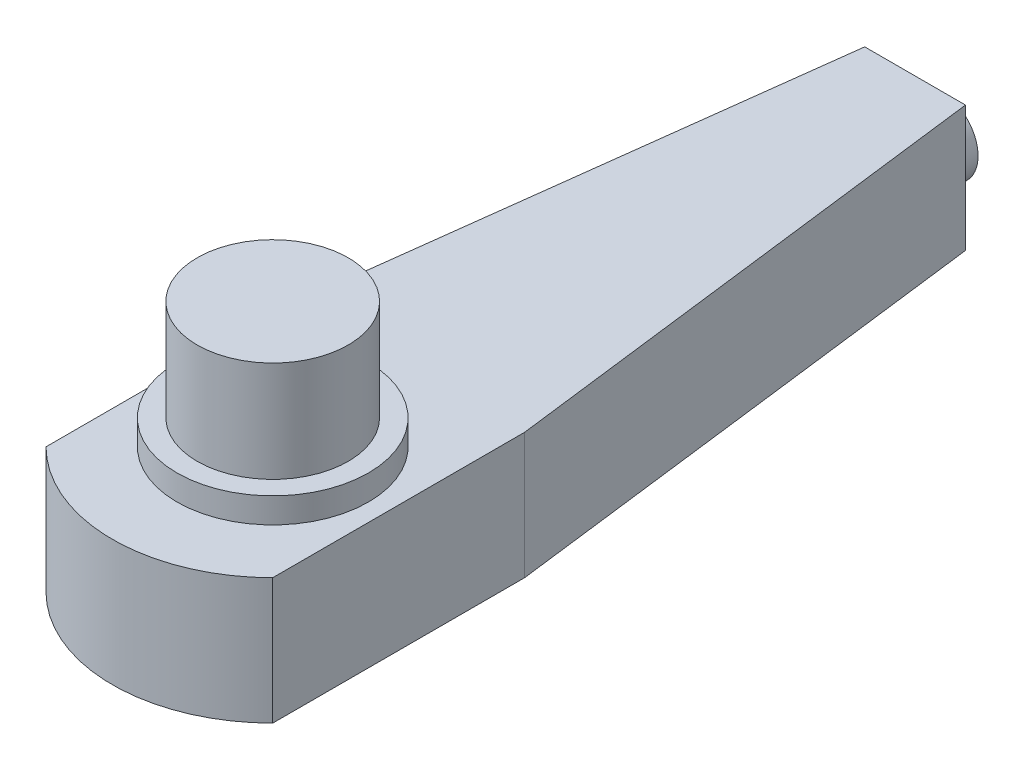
ISO-10303-21;
HEADER;
FILE_DESCRIPTION(('STEP AP214'),'2;1');
FILE_NAME('part.step','',(''),(''),'','','');
FILE_SCHEMA(('AUTOMOTIVE_DESIGN { 1 0 10303 214 1 1 1 1 }'));
ENDSEC;
DATA;
#1=APPLICATION_CONTEXT('core data for automotive mechanical design processes');
#2=APPLICATION_PROTOCOL_DEFINITION('international standard','automotive_design',2000,#1);
#3=PRODUCT_CONTEXT('',#1,'mechanical');
#4=PRODUCT('Part','Part','',(#3));
#5=PRODUCT_RELATED_PRODUCT_CATEGORY('part','',(#4));
#6=PRODUCT_DEFINITION_FORMATION('','',#4);
#7=PRODUCT_DEFINITION_CONTEXT('part definition',#1,'design');
#8=PRODUCT_DEFINITION('design','',#6,#7);
#9=PRODUCT_DEFINITION_SHAPE('','',#8);
#10=(LENGTH_UNIT() NAMED_UNIT(*) SI_UNIT(.MILLI.,.METRE.));
#11=(NAMED_UNIT(*) PLANE_ANGLE_UNIT() SI_UNIT($,.RADIAN.));
#12=(NAMED_UNIT(*) SI_UNIT($,.STERADIAN.) SOLID_ANGLE_UNIT());
#13=UNCERTAINTY_MEASURE_WITH_UNIT(LENGTH_MEASURE(1.E-05),#10,'distance_accuracy_value','');
#14=(GEOMETRIC_REPRESENTATION_CONTEXT(3) GLOBAL_UNCERTAINTY_ASSIGNED_CONTEXT((#13)) GLOBAL_UNIT_ASSIGNED_CONTEXT((#10,
#11,#12)) REPRESENTATION_CONTEXT('',''));
#15=CARTESIAN_POINT('',(0.,0.,0.));
#16=DIRECTION('',(0.,0.,1.));
#17=DIRECTION('',(1.,0.,0.));
#18=AXIS2_PLACEMENT_3D('',#15,#16,#17);
#19=CARTESIAN_POINT('',(0.,25.,52.4999999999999));
#20=DIRECTION('',(0.,-1.,0.));
#21=DIRECTION('',(0.,0.,-1.));
#22=AXIS2_PLACEMENT_3D('',#19,#20,#21);
#23=CYLINDRICAL_SURFACE('',#22,31.8198051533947);
#24=CARTESIAN_POINT('',(0.,0.,52.4999999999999));
#25=DIRECTION('',(0.,1.,0.));
#26=DIRECTION('',(0.,0.,-1.));
#27=AXIS2_PLACEMENT_3D('',#24,#25,#26);
#28=CIRCLE('',#27,31.8198051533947);
#29=CARTESIAN_POINT('',(-22.5,0.,75.));
#30=VERTEX_POINT('',#29);
#31=CARTESIAN_POINT('',(22.5,0.,75.));
#32=VERTEX_POINT('',#31);
#33=EDGE_CURVE('E127',#30,#32,#28,.T.);
#34=ORIENTED_EDGE('',*,*,#33,.T.);
#35=DIRECTION('',(0.,-1.,0.));
#36=VECTOR('',#35,1.);
#37=CARTESIAN_POINT('',(22.5,25.,75.));
#38=LINE('',#37,#36);
#39=CARTESIAN_POINT('',(22.5,25.,75.));
#40=VERTEX_POINT('',#39);
#41=EDGE_CURVE('E144',#40,#32,#38,.T.);
#42=ORIENTED_EDGE('',*,*,#41,.F.);
#43=CARTESIAN_POINT('',(0.,25.,52.4999999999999));
#44=DIRECTION('',(0.,1.,0.));
#45=DIRECTION('',(0.,0.,-1.));
#46=AXIS2_PLACEMENT_3D('',#43,#44,#45);
#47=CIRCLE('',#46,31.8198051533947);
#48=CARTESIAN_POINT('',(-22.5,25.,75.));
#49=VERTEX_POINT('',#48);
#50=EDGE_CURVE('E138',#49,#40,#47,.T.);
#51=ORIENTED_EDGE('',*,*,#50,.F.);
#52=DIRECTION('',(0.,-1.,0.));
#53=VECTOR('',#52,1.);
#54=CARTESIAN_POINT('',(-22.5,25.,75.));
#55=LINE('',#54,#53);
#56=EDGE_CURVE('E123',#49,#30,#55,.T.);
#57=ORIENTED_EDGE('',*,*,#56,.T.);
#58=EDGE_LOOP('',(#34,#42,#51,#57));
#59=FACE_BOUND('',#58,.T.);
#60=ADVANCED_FACE('F40',(#59),#23,.T.);
#61=CARTESIAN_POINT('',(22.5,25.,75.));
#62=DIRECTION('',(-1.,0.,0.));
#63=DIRECTION('',(0.,0.,1.));
#64=AXIS2_PLACEMENT_3D('',#61,#62,#63);
#65=PLANE('',#64);
#66=DIRECTION('',(0.,0.,-1.));
#67=VECTOR('',#66,1.);
#68=CARTESIAN_POINT('',(22.5,0.,75.));
#69=LINE('',#68,#67);
#70=CARTESIAN_POINT('',(22.5,0.,25.));
#71=VERTEX_POINT('',#70);
#72=EDGE_CURVE('E130',#32,#71,#69,.T.);
#73=ORIENTED_EDGE('',*,*,#72,.T.);
#74=DIRECTION('',(0.,-1.,0.));
#75=VECTOR('',#74,1.);
#76=CARTESIAN_POINT('',(22.5,25.,25.));
#77=LINE('',#76,#75);
#78=CARTESIAN_POINT('',(22.5,25.,25.));
#79=VERTEX_POINT('',#78);
#80=EDGE_CURVE('E142',#79,#71,#77,.T.);
#81=ORIENTED_EDGE('',*,*,#80,.F.);
#82=DIRECTION('',(0.,0.,-1.));
#83=VECTOR('',#82,1.);
#84=CARTESIAN_POINT('',(22.5,25.,75.));
#85=LINE('',#84,#83);
#86=EDGE_CURVE('E96',#40,#79,#85,.T.);
#87=ORIENTED_EDGE('',*,*,#86,.F.);
#88=ORIENTED_EDGE('',*,*,#41,.T.);
#89=EDGE_LOOP('',(#73,#81,#87,#88));
#90=FACE_BOUND('',#89,.T.);
#91=ADVANCED_FACE('F160',(#90),#65,.F.);
#92=CARTESIAN_POINT('',(22.5,25.,25.));
#93=DIRECTION('',(-0.992277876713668,0.,0.124034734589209));
#94=DIRECTION('',(0.124034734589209,0.,0.992277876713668));
#95=AXIS2_PLACEMENT_3D('',#92,#93,#94);
#96=PLANE('',#95);
#97=DIRECTION('',(-0.124034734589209,0.,-0.992277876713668));
#98=VECTOR('',#97,1.);
#99=CARTESIAN_POINT('',(22.5,0.,25.));
#100=LINE('',#99,#98);
#101=CARTESIAN_POINT('',(10.,0.,-75.));
#102=VERTEX_POINT('',#101);
#103=EDGE_CURVE('E133',#71,#102,#100,.T.);
#104=ORIENTED_EDGE('',*,*,#103,.T.);
#105=DIRECTION('',(0.,-1.,0.));
#106=VECTOR('',#105,1.);
#107=CARTESIAN_POINT('',(10.,25.,-75.));
#108=LINE('',#107,#106);
#109=CARTESIAN_POINT('',(10.,25.,-75.));
#110=VERTEX_POINT('',#109);
#111=EDGE_CURVE('E118',#110,#102,#108,.T.);
#112=ORIENTED_EDGE('',*,*,#111,.F.);
#113=DIRECTION('',(-0.124034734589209,0.,-0.992277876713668));
#114=VECTOR('',#113,1.);
#115=CARTESIAN_POINT('',(22.5,25.,25.));
#116=LINE('',#115,#114);
#117=EDGE_CURVE('E109',#79,#110,#116,.T.);
#118=ORIENTED_EDGE('',*,*,#117,.F.);
#119=ORIENTED_EDGE('',*,*,#80,.T.);
#120=EDGE_LOOP('',(#104,#112,#118,#119));
#121=FACE_BOUND('',#120,.T.);
#122=ADVANCED_FACE('F163',(#121),#96,.F.);
#123=CARTESIAN_POINT('',(10.,25.,-75.));
#124=DIRECTION('',(0.,0.,1.));
#125=DIRECTION('',(1.,0.,0.));
#126=AXIS2_PLACEMENT_3D('',#123,#124,#125);
#127=PLANE('',#126);
#128=CARTESIAN_POINT('',(0.,12.5,-75.));
#129=DIRECTION('',(0.,0.,-1.));
#130=DIRECTION('',(-1.,0.,0.));
#131=AXIS2_PLACEMENT_3D('',#128,#129,#130);
#132=CIRCLE('',#131,7.5);
#133=CARTESIAN_POINT('',(-7.5,12.5,-75.));
#134=VERTEX_POINT('',#133);
#135=EDGE_CURVE('E11',#134,#134,#132,.T.);
#136=ORIENTED_EDGE('',*,*,#135,.F.);
#137=EDGE_LOOP('',(#136));
#138=FACE_BOUND('',#137,.T.);
#139=DIRECTION('',(-1.,0.,0.));
#140=VECTOR('',#139,1.);
#141=CARTESIAN_POINT('',(10.,0.,-75.));
#142=LINE('',#141,#140);
#143=CARTESIAN_POINT('',(-10.,0.,-75.));
#144=VERTEX_POINT('',#143);
#145=EDGE_CURVE('E117',#102,#144,#142,.T.);
#146=ORIENTED_EDGE('',*,*,#145,.T.);
#147=DIRECTION('',(0.,-1.,0.));
#148=VECTOR('',#147,1.);
#149=CARTESIAN_POINT('',(-10.,25.,-75.));
#150=LINE('',#149,#148);
#151=CARTESIAN_POINT('',(-10.,25.,-75.));
#152=VERTEX_POINT('',#151);
#153=EDGE_CURVE('E114',#152,#144,#150,.T.);
#154=ORIENTED_EDGE('',*,*,#153,.F.);
#155=DIRECTION('',(-1.,0.,0.));
#156=VECTOR('',#155,1.);
#157=CARTESIAN_POINT('',(10.,25.,-75.));
#158=LINE('',#157,#156);
#159=EDGE_CURVE('E103',#110,#152,#158,.T.);
#160=ORIENTED_EDGE('',*,*,#159,.F.);
#161=ORIENTED_EDGE('',*,*,#111,.T.);
#162=EDGE_LOOP('',(#146,#154,#160,#161));
#163=FACE_BOUND('',#162,.T.);
#164=ADVANCED_FACE('F115',(#138,#163),#127,.F.);
#165=CARTESIAN_POINT('',(-22.5,25.,25.));
#166=DIRECTION('',(0.992277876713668,0.,0.124034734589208));
#167=DIRECTION('',(0.124034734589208,0.,-0.992277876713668));
#168=AXIS2_PLACEMENT_3D('',#165,#166,#167);
#169=PLANE('',#168);
#170=DIRECTION('',(-0.124034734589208,0.,0.992277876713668));
#171=VECTOR('',#170,1.);
#172=CARTESIAN_POINT('',(-22.5,0.,25.));
#173=LINE('',#172,#171);
#174=CARTESIAN_POINT('',(-22.5,0.,25.));
#175=VERTEX_POINT('',#174);
#176=EDGE_CURVE('E81',#144,#175,#173,.T.);
#177=ORIENTED_EDGE('',*,*,#176,.T.);
#178=DIRECTION('',(0.,-1.,0.));
#179=VECTOR('',#178,1.);
#180=CARTESIAN_POINT('',(-22.5,25.,25.));
#181=LINE('',#180,#179);
#182=CARTESIAN_POINT('',(-22.5,25.,25.));
#183=VERTEX_POINT('',#182);
#184=EDGE_CURVE('E119',#183,#175,#181,.T.);
#185=ORIENTED_EDGE('',*,*,#184,.F.);
#186=DIRECTION('',(-0.124034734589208,0.,0.992277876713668));
#187=VECTOR('',#186,1.);
#188=CARTESIAN_POINT('',(-22.5,25.,25.));
#189=LINE('',#188,#187);
#190=EDGE_CURVE('E107',#152,#183,#189,.T.);
#191=ORIENTED_EDGE('',*,*,#190,.F.);
#192=ORIENTED_EDGE('',*,*,#153,.T.);
#193=EDGE_LOOP('',(#177,#185,#191,#192));
#194=FACE_BOUND('',#193,.T.);
#195=ADVANCED_FACE('F121',(#194),#169,.F.);
#196=CARTESIAN_POINT('',(-22.5,25.,75.));
#197=DIRECTION('',(1.,0.,0.));
#198=DIRECTION('',(0.,0.,-1.));
#199=AXIS2_PLACEMENT_3D('',#196,#197,#198);
#200=PLANE('',#199);
#201=DIRECTION('',(0.,0.,1.));
#202=VECTOR('',#201,1.);
#203=CARTESIAN_POINT('',(-22.5,0.,75.));
#204=LINE('',#203,#202);
#205=EDGE_CURVE('E87',#175,#30,#204,.T.);
#206=ORIENTED_EDGE('',*,*,#205,.T.);
#207=ORIENTED_EDGE('',*,*,#56,.F.);
#208=DIRECTION('',(0.,0.,1.));
#209=VECTOR('',#208,1.);
#210=CARTESIAN_POINT('',(-22.5,25.,75.));
#211=LINE('',#210,#209);
#212=EDGE_CURVE('E58',#183,#49,#211,.T.);
#213=ORIENTED_EDGE('',*,*,#212,.F.);
#214=ORIENTED_EDGE('',*,*,#184,.T.);
#215=EDGE_LOOP('',(#206,#207,#213,#214));
#216=FACE_BOUND('',#215,.T.);
#217=ADVANCED_FACE('F168',(#216),#200,.F.);
#218=CARTESIAN_POINT('',(0.,25.,52.4999999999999));
#219=DIRECTION('',(0.,-1.,0.));
#220=DIRECTION('',(0.,0.,-1.));
#221=AXIS2_PLACEMENT_3D('',#218,#219,#220);
#222=PLANE('',#221);
#223=CARTESIAN_POINT('',(0.,25.,52.4999999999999));
#224=DIRECTION('',(0.,-1.,0.));
#225=DIRECTION('',(0.,0.,-1.));
#226=AXIS2_PLACEMENT_3D('',#223,#224,#225);
#227=CIRCLE('',#226,19.);
#228=CARTESIAN_POINT('',(0.,25.,33.4999999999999));
#229=VERTEX_POINT('',#228);
#230=EDGE_CURVE('E43',#229,#229,#227,.F.);
#231=ORIENTED_EDGE('',*,*,#230,.F.);
#232=EDGE_LOOP('',(#231));
#233=FACE_BOUND('',#232,.T.);
#234=ORIENTED_EDGE('',*,*,#50,.T.);
#235=ORIENTED_EDGE('',*,*,#86,.T.);
#236=ORIENTED_EDGE('',*,*,#117,.T.);
#237=ORIENTED_EDGE('',*,*,#159,.T.);
#238=ORIENTED_EDGE('',*,*,#190,.T.);
#239=ORIENTED_EDGE('',*,*,#212,.T.);
#240=EDGE_LOOP('',(#234,#235,#236,#237,#238,#239));
#241=FACE_BOUND('',#240,.T.);
#242=ADVANCED_FACE('F105',(#233,#241),#222,.F.);
#243=CARTESIAN_POINT('',(0.,0.,52.4999999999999));
#244=DIRECTION('',(0.,-1.,0.));
#245=DIRECTION('',(0.,0.,-1.));
#246=AXIS2_PLACEMENT_3D('',#243,#244,#245);
#247=PLANE('',#246);
#248=ORIENTED_EDGE('',*,*,#33,.F.);
#249=ORIENTED_EDGE('',*,*,#205,.F.);
#250=ORIENTED_EDGE('',*,*,#176,.F.);
#251=ORIENTED_EDGE('',*,*,#145,.F.);
#252=ORIENTED_EDGE('',*,*,#103,.F.);
#253=ORIENTED_EDGE('',*,*,#72,.F.);
#254=EDGE_LOOP('',(#248,#249,#250,#251,#252,#253));
#255=FACE_BOUND('',#254,.T.);
#256=ADVANCED_FACE('F166',(#255),#247,.T.);
#257=CARTESIAN_POINT('',(0.,30.,52.4999999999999));
#258=DIRECTION('',(0.,-1.,0.));
#259=DIRECTION('',(0.,0.,-1.));
#260=AXIS2_PLACEMENT_3D('',#257,#258,#259);
#261=CYLINDRICAL_SURFACE('',#260,19.);
#262=CARTESIAN_POINT('',(0.,30.,52.4999999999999));
#263=DIRECTION('',(0.,1.,0.));
#264=DIRECTION('',(0.,0.,1.));
#265=AXIS2_PLACEMENT_3D('',#262,#263,#264);
#266=CIRCLE('',#265,19.);
#267=CARTESIAN_POINT('',(0.,30.,71.4999999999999));
#268=VERTEX_POINT('',#267);
#269=EDGE_CURVE('E131',#268,#268,#266,.T.);
#270=ORIENTED_EDGE('',*,*,#269,.F.);
#271=EDGE_LOOP('',(#270));
#272=FACE_BOUND('',#271,.T.);
#273=ORIENTED_EDGE('',*,*,#230,.T.);
#274=EDGE_LOOP('',(#273));
#275=FACE_BOUND('',#274,.T.);
#276=ADVANCED_FACE('F217',(#272,#275),#261,.T.);
#277=CARTESIAN_POINT('',(0.,30.,52.4999999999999));
#278=DIRECTION('',(0.,1.,0.));
#279=DIRECTION('',(0.,0.,1.));
#280=AXIS2_PLACEMENT_3D('',#277,#278,#279);
#281=PLANE('',#280);
#282=CARTESIAN_POINT('',(0.,30.,52.4999999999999));
#283=DIRECTION('',(0.,1.,0.));
#284=DIRECTION('',(0.,0.,1.));
#285=AXIS2_PLACEMENT_3D('',#282,#283,#284);
#286=CIRCLE('',#285,15.);
#287=CARTESIAN_POINT('',(0.,30.,67.4999999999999));
#288=VERTEX_POINT('',#287);
#289=EDGE_CURVE('E49',#288,#288,#286,.T.);
#290=ORIENTED_EDGE('',*,*,#289,.F.);
#291=EDGE_LOOP('',(#290));
#292=FACE_BOUND('',#291,.T.);
#293=ORIENTED_EDGE('',*,*,#269,.T.);
#294=EDGE_LOOP('',(#293));
#295=FACE_BOUND('',#294,.T.);
#296=ADVANCED_FACE('F213',(#292,#295),#281,.T.);
#297=CARTESIAN_POINT('',(0.,50.,52.4999999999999));
#298=DIRECTION('',(0.,-1.,0.));
#299=DIRECTION('',(0.,0.,-1.));
#300=AXIS2_PLACEMENT_3D('',#297,#298,#299);
#301=CYLINDRICAL_SURFACE('',#300,15.);
#302=CARTESIAN_POINT('',(0.,50.,52.4999999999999));
#303=DIRECTION('',(0.,1.,0.));
#304=DIRECTION('',(0.,0.,1.));
#305=AXIS2_PLACEMENT_3D('',#302,#303,#304);
#306=CIRCLE('',#305,15.);
#307=CARTESIAN_POINT('',(0.,50.,67.4999999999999));
#308=VERTEX_POINT('',#307);
#309=EDGE_CURVE('E155',#308,#308,#306,.T.);
#310=ORIENTED_EDGE('',*,*,#309,.F.);
#311=EDGE_LOOP('',(#310));
#312=FACE_BOUND('',#311,.T.);
#313=ORIENTED_EDGE('',*,*,#289,.T.);
#314=EDGE_LOOP('',(#313));
#315=FACE_BOUND('',#314,.T.);
#316=ADVANCED_FACE('F206',(#312,#315),#301,.T.);
#317=CARTESIAN_POINT('',(0.,50.,52.4999999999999));
#318=DIRECTION('',(0.,1.,0.));
#319=DIRECTION('',(0.,0.,1.));
#320=AXIS2_PLACEMENT_3D('',#317,#318,#319);
#321=PLANE('',#320);
#322=ORIENTED_EDGE('',*,*,#309,.T.);
#323=EDGE_LOOP('',(#322));
#324=FACE_BOUND('',#323,.T.);
#325=ADVANCED_FACE('F197',(#324),#321,.T.);
#326=CARTESIAN_POINT('',(0.,12.5,-80.));
#327=DIRECTION('',(0.,0.,1.));
#328=DIRECTION('',(1.,0.,0.));
#329=AXIS2_PLACEMENT_3D('',#326,#327,#328);
#330=CYLINDRICAL_SURFACE('',#329,7.5);
#331=CARTESIAN_POINT('',(0.,12.5,-80.));
#332=DIRECTION('',(0.,0.,-1.));
#333=DIRECTION('',(-1.,0.,0.));
#334=AXIS2_PLACEMENT_3D('',#331,#332,#333);
#335=CIRCLE('',#334,7.5);
#336=CARTESIAN_POINT('',(-7.5,12.5,-80.));
#337=VERTEX_POINT('',#336);
#338=EDGE_CURVE('E302',#337,#337,#335,.T.);
#339=ORIENTED_EDGE('',*,*,#338,.F.);
#340=EDGE_LOOP('',(#339));
#341=FACE_BOUND('',#340,.T.);
#342=ORIENTED_EDGE('',*,*,#135,.T.);
#343=EDGE_LOOP('',(#342));
#344=FACE_BOUND('',#343,.T.);
#345=ADVANCED_FACE('F194',(#341,#344),#330,.T.);
#346=CARTESIAN_POINT('',(0.,12.5,-80.));
#347=DIRECTION('',(0.,0.,-1.));
#348=DIRECTION('',(-1.,0.,0.));
#349=AXIS2_PLACEMENT_3D('',#346,#347,#348);
#350=PLANE('',#349);
#351=ORIENTED_EDGE('',*,*,#338,.T.);
#352=EDGE_LOOP('',(#351));
#353=FACE_BOUND('',#352,.T.);
#354=ADVANCED_FACE('F196',(#353),#350,.T.);
#355=CLOSED_SHELL('',(#60,#91,#122,#164,#195,#217,#242,#256,#276,#296,#316,#325,#345,#354));
#356=MANIFOLD_SOLID_BREP('B2',#355);
#357=ADVANCED_BREP_SHAPE_REPRESENTATION('',(#18,#356),#14);
#358=SHAPE_DEFINITION_REPRESENTATION(#9,#357);
ENDSEC;
END-ISO-10303-21;
